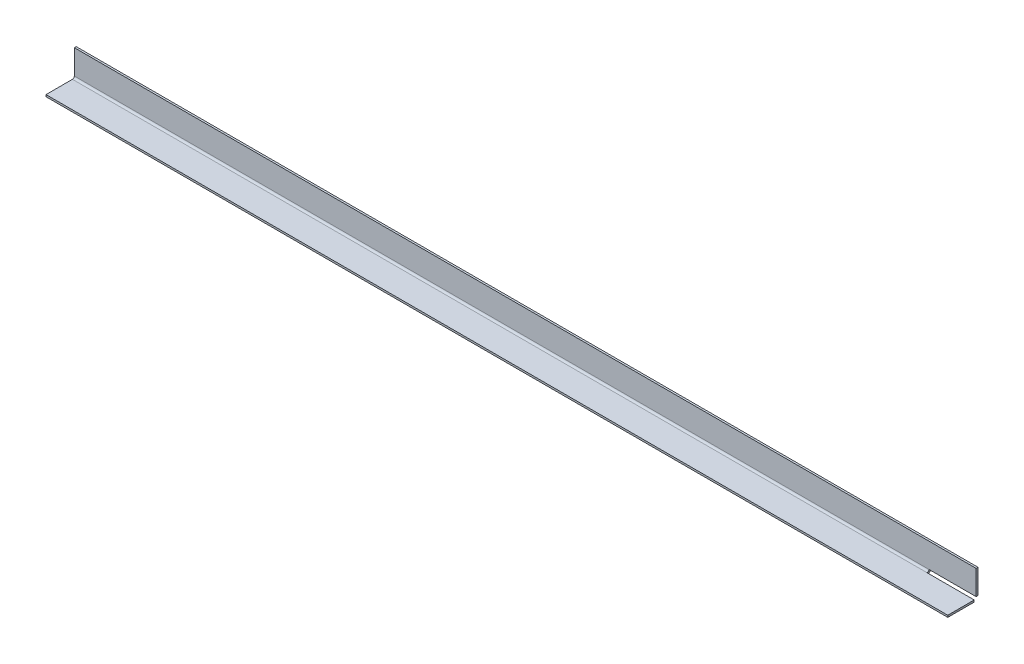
ISO-10303-21;
HEADER;
FILE_DESCRIPTION(('STEP AP214'),'2;1');
FILE_NAME('part.step','',(''),(''),'','','');
FILE_SCHEMA(('AUTOMOTIVE_DESIGN { 1 0 10303 214 1 1 1 1 }'));
ENDSEC;
DATA;
#1=APPLICATION_CONTEXT('core data for automotive mechanical design processes');
#2=APPLICATION_PROTOCOL_DEFINITION('international standard','automotive_design',2000,#1);
#3=PRODUCT_CONTEXT('',#1,'mechanical');
#4=PRODUCT('Part','Part','',(#3));
#5=PRODUCT_RELATED_PRODUCT_CATEGORY('part','',(#4));
#6=PRODUCT_DEFINITION_FORMATION('','',#4);
#7=PRODUCT_DEFINITION_CONTEXT('part definition',#1,'design');
#8=PRODUCT_DEFINITION('design','',#6,#7);
#9=PRODUCT_DEFINITION_SHAPE('','',#8);
#10=(LENGTH_UNIT() NAMED_UNIT(*) SI_UNIT(.MILLI.,.METRE.));
#11=(NAMED_UNIT(*) PLANE_ANGLE_UNIT() SI_UNIT($,.RADIAN.));
#12=(NAMED_UNIT(*) SI_UNIT($,.STERADIAN.) SOLID_ANGLE_UNIT());
#13=UNCERTAINTY_MEASURE_WITH_UNIT(LENGTH_MEASURE(1.E-05),#10,'distance_accuracy_value','');
#14=(GEOMETRIC_REPRESENTATION_CONTEXT(3) GLOBAL_UNCERTAINTY_ASSIGNED_CONTEXT((#13)) GLOBAL_UNIT_ASSIGNED_CONTEXT((#10,
#11,#12)) REPRESENTATION_CONTEXT('',''));
#15=CARTESIAN_POINT('',(0.,0.,0.));
#16=DIRECTION('',(0.,0.,1.));
#17=DIRECTION('',(1.,0.,0.));
#18=AXIS2_PLACEMENT_3D('',#15,#16,#17);
#19=CARTESIAN_POINT('',(-905.,-1.10830535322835E-13,2.));
#20=DIRECTION('',(1.,0.,0.));
#21=DIRECTION('',(0.,0.,-1.));
#22=AXIS2_PLACEMENT_3D('',#19,#20,#21);
#23=PLANE('',#22);
#24=DIRECTION('',(0.,0.,-1.));
#25=VECTOR('',#24,1.);
#26=CARTESIAN_POINT('',(-905.,3.99999999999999,1.99999999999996));
#27=LINE('',#26,#25);
#28=CARTESIAN_POINT('',(-905.,4.,2.));
#29=VERTEX_POINT('',#28);
#30=CARTESIAN_POINT('',(-905.,4.,0.));
#31=VERTEX_POINT('',#30);
#32=EDGE_CURVE('E69',#29,#31,#27,.T.);
#33=ORIENTED_EDGE('',*,*,#32,.F.);
#34=DIRECTION('',(0.,-1.,0.));
#35=VECTOR('',#34,1.);
#36=CARTESIAN_POINT('',(-905.,-1.10830535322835E-13,2.));
#37=LINE('',#36,#35);
#38=CARTESIAN_POINT('',(-905.,29.9999999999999,2.));
#39=VERTEX_POINT('',#38);
#40=EDGE_CURVE('E62',#39,#29,#37,.T.);
#41=ORIENTED_EDGE('',*,*,#40,.F.);
#42=DIRECTION('',(0.,0.,-1.));
#43=VECTOR('',#42,1.);
#44=CARTESIAN_POINT('',(-905.,29.9999999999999,2.));
#45=LINE('',#44,#43);
#46=CARTESIAN_POINT('',(-905.,29.9999999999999,0.));
#47=VERTEX_POINT('',#46);
#48=EDGE_CURVE('E13',#39,#47,#45,.T.);
#49=ORIENTED_EDGE('',*,*,#48,.T.);
#50=DIRECTION('',(0.,-1.,0.));
#51=VECTOR('',#50,1.);
#52=CARTESIAN_POINT('',(-905.,-1.10830535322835E-13,0.));
#53=LINE('',#52,#51);
#54=EDGE_CURVE('E186',#47,#31,#53,.T.);
#55=ORIENTED_EDGE('',*,*,#54,.T.);
#56=EDGE_LOOP('',(#33,#41,#49,#55));
#57=FACE_BOUND('',#56,.T.);
#58=ADVANCED_FACE('F54',(#57),#23,.F.);
#59=CARTESIAN_POINT('',(0.,30.,2.));
#60=DIRECTION('',(0.,0.,1.));
#61=DIRECTION('',(1.,0.,0.));
#62=AXIS2_PLACEMENT_3D('',#59,#60,#61);
#63=PLANE('',#62);
#64=ORIENTED_EDGE('',*,*,#40,.T.);
#65=DIRECTION('',(1.,0.,0.));
#66=VECTOR('',#65,1.);
#67=CARTESIAN_POINT('',(0.,3.99999999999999,1.99999999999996));
#68=LINE('',#67,#66);
#69=CARTESIAN_POINT('',(0.,3.99999999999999,2.));
#70=VERTEX_POINT('',#69);
#71=EDGE_CURVE('E76',#70,#29,#68,.F.);
#72=ORIENTED_EDGE('',*,*,#71,.F.);
#73=DIRECTION('',(-1.,0.,0.));
#74=VECTOR('',#73,1.);
#75=CARTESIAN_POINT('',(50.,3.99999999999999,2.));
#76=LINE('',#75,#74);
#77=CARTESIAN_POINT('',(50.,3.99999999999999,2.));
#78=VERTEX_POINT('',#77);
#79=EDGE_CURVE('E205',#78,#70,#76,.T.);
#80=ORIENTED_EDGE('',*,*,#79,.F.);
#81=DIRECTION('',(0.,-1.,0.));
#82=VECTOR('',#81,1.);
#83=CARTESIAN_POINT('',(50.,30.,2.));
#84=LINE('',#83,#82);
#85=CARTESIAN_POINT('',(50.,30.,2.));
#86=VERTEX_POINT('',#85);
#87=EDGE_CURVE('E222',#86,#78,#84,.T.);
#88=ORIENTED_EDGE('',*,*,#87,.F.);
#89=DIRECTION('',(-1.,0.,0.));
#90=VECTOR('',#89,1.);
#91=CARTESIAN_POINT('',(0.,30.,2.));
#92=LINE('',#91,#90);
#93=EDGE_CURVE('E184',#86,#39,#92,.T.);
#94=ORIENTED_EDGE('',*,*,#93,.T.);
#95=EDGE_LOOP('',(#64,#72,#80,#88,#94));
#96=FACE_BOUND('',#95,.T.);
#97=ADVANCED_FACE('F260',(#96),#63,.T.);
#98=CARTESIAN_POINT('',(0.,30.,0.));
#99=DIRECTION('',(0.,0.,1.));
#100=DIRECTION('',(1.,0.,0.));
#101=AXIS2_PLACEMENT_3D('',#98,#99,#100);
#102=PLANE('',#101);
#103=DIRECTION('',(1.,0.,0.));
#104=VECTOR('',#103,1.);
#105=CARTESIAN_POINT('',(0.,4.00000000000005,0.));
#106=LINE('',#105,#104);
#107=CARTESIAN_POINT('',(0.,3.99999999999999,0.));
#108=VERTEX_POINT('',#107);
#109=EDGE_CURVE('E199',#108,#31,#106,.F.);
#110=ORIENTED_EDGE('',*,*,#109,.T.);
#111=ORIENTED_EDGE('',*,*,#54,.F.);
#112=DIRECTION('',(-1.,0.,0.));
#113=VECTOR('',#112,1.);
#114=CARTESIAN_POINT('',(0.,30.,0.));
#115=LINE('',#114,#113);
#116=CARTESIAN_POINT('',(50.,30.,0.));
#117=VERTEX_POINT('',#116);
#118=EDGE_CURVE('E181',#117,#47,#115,.T.);
#119=ORIENTED_EDGE('',*,*,#118,.F.);
#120=DIRECTION('',(0.,1.,0.));
#121=VECTOR('',#120,1.);
#122=CARTESIAN_POINT('',(50.,30.,0.));
#123=LINE('',#122,#121);
#124=CARTESIAN_POINT('',(50.,3.99999999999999,0.));
#125=VERTEX_POINT('',#124);
#126=EDGE_CURVE('E227',#125,#117,#123,.T.);
#127=ORIENTED_EDGE('',*,*,#126,.F.);
#128=DIRECTION('',(-1.,0.,0.));
#129=VECTOR('',#128,1.);
#130=CARTESIAN_POINT('',(50.,3.99999999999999,0.));
#131=LINE('',#130,#129);
#132=EDGE_CURVE('E217',#125,#108,#131,.T.);
#133=ORIENTED_EDGE('',*,*,#132,.T.);
#134=EDGE_LOOP('',(#110,#111,#119,#127,#133));
#135=FACE_BOUND('',#134,.T.);
#136=ADVANCED_FACE('F264',(#135),#102,.F.);
#137=CARTESIAN_POINT('',(0.,30.,2.));
#138=DIRECTION('',(0.,-1.,0.));
#139=DIRECTION('',(1.,0.,0.));
#140=AXIS2_PLACEMENT_3D('',#137,#138,#139);
#141=PLANE('',#140);
#142=ORIENTED_EDGE('',*,*,#118,.T.);
#143=ORIENTED_EDGE('',*,*,#48,.F.);
#144=ORIENTED_EDGE('',*,*,#93,.F.);
#145=DIRECTION('',(0.,0.,1.));
#146=VECTOR('',#145,1.);
#147=CARTESIAN_POINT('',(50.,30.,0.));
#148=LINE('',#147,#146);
#149=EDGE_CURVE('E224',#117,#86,#148,.T.);
#150=ORIENTED_EDGE('',*,*,#149,.F.);
#151=EDGE_LOOP('',(#142,#143,#144,#150));
#152=FACE_BOUND('',#151,.T.);
#153=ADVANCED_FACE('F56',(#152),#141,.F.);
#154=CARTESIAN_POINT('',(-905.,3.99999999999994,4.00000000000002));
#155=DIRECTION('',(-1.,0.,0.));
#156=DIRECTION('',(0.,0.,1.));
#157=AXIS2_PLACEMENT_3D('',#154,#155,#156);
#158=PLANE('',#157);
#159=DIRECTION('',(0.,1.,0.));
#160=VECTOR('',#159,1.);
#161=CARTESIAN_POINT('',(-905.,-1.18005269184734E-13,3.99999999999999));
#162=LINE('',#161,#160);
#163=CARTESIAN_POINT('',(-905.,1.99999999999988,4.00000000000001));
#164=VERTEX_POINT('',#163);
#165=CARTESIAN_POINT('',(-905.,-1.17961196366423E-13,4.));
#166=VERTEX_POINT('',#165);
#167=EDGE_CURVE('E167',#164,#166,#162,.F.);
#168=ORIENTED_EDGE('',*,*,#167,.F.);
#169=CARTESIAN_POINT('',(-905.,3.99999999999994,4.00000000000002));
#170=DIRECTION('',(1.,0.,0.));
#171=DIRECTION('',(0.,0.,-1.));
#172=AXIS2_PLACEMENT_3D('',#169,#170,#171);
#173=CIRCLE('',#172,2.00000000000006);
#174=EDGE_CURVE('E166',#29,#164,#173,.F.);
#175=ORIENTED_EDGE('',*,*,#174,.F.);
#176=ORIENTED_EDGE('',*,*,#32,.T.);
#177=CARTESIAN_POINT('',(-905.,3.99999999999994,4.00000000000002));
#178=DIRECTION('',(1.,0.,0.));
#179=DIRECTION('',(0.,0.,-1.));
#180=AXIS2_PLACEMENT_3D('',#177,#178,#179);
#181=CIRCLE('',#180,4.00000000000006);
#182=EDGE_CURVE('E183',#31,#166,#181,.F.);
#183=ORIENTED_EDGE('',*,*,#182,.T.);
#184=EDGE_LOOP('',(#168,#175,#176,#183));
#185=FACE_BOUND('',#184,.T.);
#186=ADVANCED_FACE('F194',(#185),#158,.T.);
#187=CARTESIAN_POINT('',(0.,3.99999999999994,4.00000000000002));
#188=DIRECTION('',(-1.,0.,0.));
#189=DIRECTION('',(0.,0.,1.));
#190=AXIS2_PLACEMENT_3D('',#187,#188,#189);
#191=PLANE('',#190);
#192=CARTESIAN_POINT('',(0.,3.99999999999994,4.00000000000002));
#193=DIRECTION('',(1.,0.,0.));
#194=DIRECTION('',(0.,0.,-1.));
#195=AXIS2_PLACEMENT_3D('',#192,#193,#194);
#196=CIRCLE('',#195,2.00000000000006);
#197=CARTESIAN_POINT('',(0.,1.99999999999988,4.00000000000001));
#198=VERTEX_POINT('',#197);
#199=EDGE_CURVE('E163',#198,#70,#196,.T.);
#200=ORIENTED_EDGE('',*,*,#199,.F.);
#201=DIRECTION('',(0.,1.,0.));
#202=VECTOR('',#201,1.);
#203=CARTESIAN_POINT('',(0.,1.99999999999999,4.00000000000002));
#204=LINE('',#203,#202);
#205=CARTESIAN_POINT('',(0.,0.,4.00000000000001));
#206=VERTEX_POINT('',#205);
#207=EDGE_CURVE('E150',#198,#206,#204,.F.);
#208=ORIENTED_EDGE('',*,*,#207,.T.);
#209=CARTESIAN_POINT('',(0.,3.99999999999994,4.00000000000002));
#210=DIRECTION('',(1.,0.,0.));
#211=DIRECTION('',(0.,0.,-1.));
#212=AXIS2_PLACEMENT_3D('',#209,#210,#211);
#213=CIRCLE('',#212,4.00000000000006);
#214=EDGE_CURVE('E201',#206,#108,#213,.T.);
#215=ORIENTED_EDGE('',*,*,#214,.T.);
#216=DIRECTION('',(0.,0.,-1.));
#217=VECTOR('',#216,1.);
#218=CARTESIAN_POINT('',(0.,3.99999999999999,1.99999999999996));
#219=LINE('',#218,#217);
#220=EDGE_CURVE('E171',#70,#108,#219,.T.);
#221=ORIENTED_EDGE('',*,*,#220,.F.);
#222=EDGE_LOOP('',(#200,#208,#215,#221));
#223=FACE_BOUND('',#222,.T.);
#224=ADVANCED_FACE('F169',(#223),#191,.F.);
#225=CARTESIAN_POINT('',(0.,3.99999999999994,4.00000000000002));
#226=DIRECTION('',(1.,0.,0.));
#227=DIRECTION('',(0.,-1.,0.));
#228=AXIS2_PLACEMENT_3D('',#225,#226,#227);
#229=CYLINDRICAL_SURFACE('',#228,4.00000000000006);
#230=ORIENTED_EDGE('',*,*,#109,.F.);
#231=ORIENTED_EDGE('',*,*,#214,.F.);
#232=DIRECTION('',(1.,0.,0.));
#233=VECTOR('',#232,1.);
#234=CARTESIAN_POINT('',(-905.,-1.17961196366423E-13,3.99999999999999));
#235=LINE('',#234,#233);
#236=EDGE_CURVE('E157',#206,#166,#235,.F.);
#237=ORIENTED_EDGE('',*,*,#236,.T.);
#238=ORIENTED_EDGE('',*,*,#182,.F.);
#239=EDGE_LOOP('',(#230,#231,#237,#238));
#240=FACE_BOUND('',#239,.T.);
#241=ADVANCED_FACE('F198',(#240),#229,.T.);
#242=CARTESIAN_POINT('',(0.,3.99999999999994,4.00000000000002));
#243=DIRECTION('',(1.,0.,0.));
#244=DIRECTION('',(0.,-1.,0.));
#245=AXIS2_PLACEMENT_3D('',#242,#243,#244);
#246=CYLINDRICAL_SURFACE('',#245,2.00000000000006);
#247=ORIENTED_EDGE('',*,*,#71,.T.);
#248=ORIENTED_EDGE('',*,*,#174,.T.);
#249=DIRECTION('',(1.,0.,0.));
#250=VECTOR('',#249,1.);
#251=CARTESIAN_POINT('',(-905.,1.99999999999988,3.99999999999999));
#252=LINE('',#251,#250);
#253=EDGE_CURVE('E140',#164,#198,#252,.T.);
#254=ORIENTED_EDGE('',*,*,#253,.T.);
#255=ORIENTED_EDGE('',*,*,#199,.T.);
#256=EDGE_LOOP('',(#247,#248,#254,#255));
#257=FACE_BOUND('',#256,.T.);
#258=ADVANCED_FACE('F162',(#257),#246,.F.);
#259=CARTESIAN_POINT('',(-905.,-1.11022302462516E-13,1.99999999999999));
#260=DIRECTION('',(1.,0.,0.));
#261=DIRECTION('',(0.,1.,0.));
#262=AXIS2_PLACEMENT_3D('',#259,#260,#261);
#263=PLANE('',#262);
#264=ORIENTED_EDGE('',*,*,#167,.T.);
#265=DIRECTION('',(0.,0.,-1.));
#266=VECTOR('',#265,1.);
#267=CARTESIAN_POINT('',(-905.,-2.15539391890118E-13,32.));
#268=LINE('',#267,#266);
#269=CARTESIAN_POINT('',(-905.,-2.15539391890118E-13,32.));
#270=VERTEX_POINT('',#269);
#271=EDGE_CURVE('E212',#270,#166,#268,.T.);
#272=ORIENTED_EDGE('',*,*,#271,.F.);
#273=DIRECTION('',(0.,1.,0.));
#274=VECTOR('',#273,1.);
#275=CARTESIAN_POINT('',(-905.,-2.15766803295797E-13,32.));
#276=LINE('',#275,#274);
#277=CARTESIAN_POINT('',(-905.,1.99999999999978,32.));
#278=VERTEX_POINT('',#277);
#279=EDGE_CURVE('E172',#270,#278,#276,.T.);
#280=ORIENTED_EDGE('',*,*,#279,.T.);
#281=DIRECTION('',(0.,0.,1.));
#282=VECTOR('',#281,1.);
#283=CARTESIAN_POINT('',(-905.,1.99999999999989,2.));
#284=LINE('',#283,#282);
#285=EDGE_CURVE('E208',#278,#164,#284,.F.);
#286=ORIENTED_EDGE('',*,*,#285,.T.);
#287=EDGE_LOOP('',(#264,#272,#280,#286));
#288=FACE_BOUND('',#287,.T.);
#289=ADVANCED_FACE('F248',(#288),#263,.F.);
#290=CARTESIAN_POINT('',(-905.,-2.15539391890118E-13,32.));
#291=DIRECTION('',(0.,1.,0.));
#292=DIRECTION('',(0.,0.,1.));
#293=AXIS2_PLACEMENT_3D('',#290,#291,#292);
#294=PLANE('',#293);
#295=ORIENTED_EDGE('',*,*,#236,.F.);
#296=DIRECTION('',(-1.,0.,0.));
#297=VECTOR('',#296,1.);
#298=CARTESIAN_POINT('',(78.0713376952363,0.,3.99999999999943));
#299=LINE('',#298,#297);
#300=CARTESIAN_POINT('',(50.,0.,3.99999999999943));
#301=VERTEX_POINT('',#300);
#302=EDGE_CURVE('E147',#301,#206,#299,.T.);
#303=ORIENTED_EDGE('',*,*,#302,.F.);
#304=DIRECTION('',(0.,0.,1.));
#305=VECTOR('',#304,1.);
#306=CARTESIAN_POINT('',(50.,0.,3.99999999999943));
#307=LINE('',#306,#305);
#308=CARTESIAN_POINT('',(50.,0.,31.9999999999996));
#309=VERTEX_POINT('',#308);
#310=EDGE_CURVE('E146',#301,#309,#307,.T.);
#311=ORIENTED_EDGE('',*,*,#310,.T.);
#312=DIRECTION('',(-1.,0.,0.));
#313=VECTOR('',#312,1.);
#314=CARTESIAN_POINT('',(-905.,-2.15539391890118E-13,32.));
#315=LINE('',#314,#313);
#316=EDGE_CURVE('E176',#309,#270,#315,.T.);
#317=ORIENTED_EDGE('',*,*,#316,.T.);
#318=ORIENTED_EDGE('',*,*,#271,.T.);
#319=EDGE_LOOP('',(#295,#303,#311,#317,#318));
#320=FACE_BOUND('',#319,.T.);
#321=ADVANCED_FACE('F245',(#320),#294,.F.);
#322=CARTESIAN_POINT('',(-905.,1.99999999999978,32.));
#323=DIRECTION('',(0.,1.,0.));
#324=DIRECTION('',(0.,0.,1.));
#325=AXIS2_PLACEMENT_3D('',#322,#323,#324);
#326=PLANE('',#325);
#327=DIRECTION('',(1.,0.,0.));
#328=VECTOR('',#327,1.);
#329=CARTESIAN_POINT('',(-905.,1.99999999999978,32.));
#330=LINE('',#329,#328);
#331=CARTESIAN_POINT('',(50.,1.99999999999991,31.9999999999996));
#332=VERTEX_POINT('',#331);
#333=EDGE_CURVE('E210',#332,#278,#330,.F.);
#334=ORIENTED_EDGE('',*,*,#333,.F.);
#335=DIRECTION('',(0.,0.,-1.));
#336=VECTOR('',#335,1.);
#337=CARTESIAN_POINT('',(50.,1.99999999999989,3.99999999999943));
#338=LINE('',#337,#336);
#339=CARTESIAN_POINT('',(50.,1.99999999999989,3.99999999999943));
#340=VERTEX_POINT('',#339);
#341=EDGE_CURVE('E143',#332,#340,#338,.T.);
#342=ORIENTED_EDGE('',*,*,#341,.T.);
#343=DIRECTION('',(-1.,0.,0.));
#344=VECTOR('',#343,1.);
#345=CARTESIAN_POINT('',(78.0713376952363,1.99999999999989,3.99999999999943));
#346=LINE('',#345,#344);
#347=EDGE_CURVE('E135',#340,#198,#346,.T.);
#348=ORIENTED_EDGE('',*,*,#347,.T.);
#349=ORIENTED_EDGE('',*,*,#253,.F.);
#350=ORIENTED_EDGE('',*,*,#285,.F.);
#351=EDGE_LOOP('',(#334,#342,#348,#349,#350));
#352=FACE_BOUND('',#351,.T.);
#353=ADVANCED_FACE('F137',(#352),#326,.T.);
#354=CARTESIAN_POINT('',(-905.,-2.15539391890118E-13,32.));
#355=DIRECTION('',(0.,0.,-1.));
#356=DIRECTION('',(0.,1.,0.));
#357=AXIS2_PLACEMENT_3D('',#354,#355,#356);
#358=PLANE('',#357);
#359=ORIENTED_EDGE('',*,*,#333,.T.);
#360=ORIENTED_EDGE('',*,*,#279,.F.);
#361=ORIENTED_EDGE('',*,*,#316,.F.);
#362=DIRECTION('',(0.,1.,0.));
#363=VECTOR('',#362,1.);
#364=CARTESIAN_POINT('',(50.,1.99999999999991,31.9999999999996));
#365=LINE('',#364,#363);
#366=EDGE_CURVE('E232',#309,#332,#365,.T.);
#367=ORIENTED_EDGE('',*,*,#366,.T.);
#368=EDGE_LOOP('',(#359,#360,#361,#367));
#369=FACE_BOUND('',#368,.T.);
#370=ADVANCED_FACE('F240',(#369),#358,.F.);
#371=CARTESIAN_POINT('',(50.,3.99999999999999,0.));
#372=DIRECTION('',(0.,1.,0.));
#373=DIRECTION('',(0.,0.,1.));
#374=AXIS2_PLACEMENT_3D('',#371,#372,#373);
#375=PLANE('',#374);
#376=ORIENTED_EDGE('',*,*,#220,.T.);
#377=ORIENTED_EDGE('',*,*,#132,.F.);
#378=DIRECTION('',(0.,0.,-1.));
#379=VECTOR('',#378,1.);
#380=CARTESIAN_POINT('',(50.,3.99999999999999,0.));
#381=LINE('',#380,#379);
#382=EDGE_CURVE('E220',#78,#125,#381,.T.);
#383=ORIENTED_EDGE('',*,*,#382,.F.);
#384=ORIENTED_EDGE('',*,*,#79,.T.);
#385=EDGE_LOOP('',(#376,#377,#383,#384));
#386=FACE_BOUND('',#385,.T.);
#387=ADVANCED_FACE('F309',(#386),#375,.F.);
#388=CARTESIAN_POINT('',(50.,3.99999999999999,0.));
#389=DIRECTION('',(-1.,0.,0.));
#390=DIRECTION('',(0.,0.,1.));
#391=AXIS2_PLACEMENT_3D('',#388,#389,#390);
#392=PLANE('',#391);
#393=ORIENTED_EDGE('',*,*,#126,.T.);
#394=ORIENTED_EDGE('',*,*,#149,.T.);
#395=ORIENTED_EDGE('',*,*,#87,.T.);
#396=ORIENTED_EDGE('',*,*,#382,.T.);
#397=EDGE_LOOP('',(#393,#394,#395,#396));
#398=FACE_BOUND('',#397,.T.);
#399=ADVANCED_FACE('F319',(#398),#392,.F.);
#400=CARTESIAN_POINT('',(78.0713376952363,1.99999999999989,3.99999999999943));
#401=DIRECTION('',(0.,0.,1.));
#402=DIRECTION('',(1.,0.,0.));
#403=AXIS2_PLACEMENT_3D('',#400,#401,#402);
#404=PLANE('',#403);
#405=ORIENTED_EDGE('',*,*,#347,.F.);
#406=DIRECTION('',(0.,-1.,0.));
#407=VECTOR('',#406,1.);
#408=CARTESIAN_POINT('',(50.,1.99999999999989,3.99999999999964));
#409=LINE('',#408,#407);
#410=EDGE_CURVE('E230',#340,#301,#409,.T.);
#411=ORIENTED_EDGE('',*,*,#410,.T.);
#412=ORIENTED_EDGE('',*,*,#302,.T.);
#413=ORIENTED_EDGE('',*,*,#207,.F.);
#414=EDGE_LOOP('',(#405,#411,#412,#413));
#415=FACE_BOUND('',#414,.T.);
#416=ADVANCED_FACE('F151',(#415),#404,.F.);
#417=CARTESIAN_POINT('',(50.,3.99999999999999,0.));
#418=DIRECTION('',(-1.,0.,0.));
#419=DIRECTION('',(0.,0.,1.));
#420=AXIS2_PLACEMENT_3D('',#417,#418,#419);
#421=PLANE('',#420);
#422=ORIENTED_EDGE('',*,*,#341,.F.);
#423=ORIENTED_EDGE('',*,*,#366,.F.);
#424=ORIENTED_EDGE('',*,*,#310,.F.);
#425=ORIENTED_EDGE('',*,*,#410,.F.);
#426=EDGE_LOOP('',(#422,#423,#424,#425));
#427=FACE_BOUND('',#426,.T.);
#428=ADVANCED_FACE('F243',(#427),#421,.F.);
#429=CLOSED_SHELL('',(#58,#97,#136,#153,#186,#224,#241,#258,#289,#321,#353,#370,#387,#399,#416,#428));
#430=MANIFOLD_SOLID_BREP('B2',#429);
#431=ADVANCED_BREP_SHAPE_REPRESENTATION('',(#18,#430),#14);
#432=SHAPE_DEFINITION_REPRESENTATION(#9,#431);
ENDSEC;
END-ISO-10303-21;
